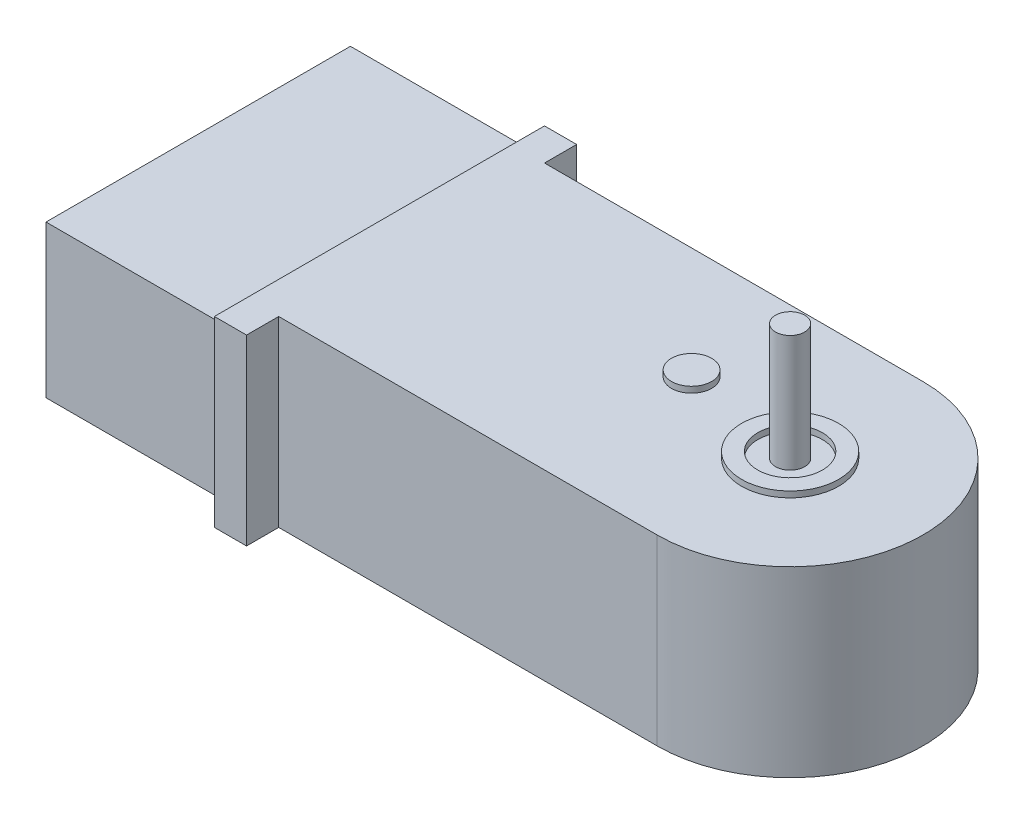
from build123d import *

# Parameters (mm, degrees)
GEAR_BOX_DEPTH      = 6.86
GEAR_BOX_DEPTH_BACK = 6.86
MOTOR_DEPTH         = 5.715
MOTOR_DEPTH_BACK    = 5.715
SKETCH2_W           = 13.61
SKETCH2_H           = 22.86
SKETCH3_R           = 1.51
SKETCH3_R_2         = 3.645
SKETCH3_R_3         = 2.43
SPACER_DEPTH        = 0.45
SPACER_BACK_START   = 0.45
SKETCH5_R           = 3.645
SKETCH5_R_2         = 2.43
SPACER_BACK_DEPTH   = 0.45
SKETCH4_R           = 1.095
OUTPUT_SHAFT_DEPTH  = 8.76


with BuildPart() as part:
    # Sketch1 → Gear Box (new, two sides: drawn at the far end of the back side and taken through both)
    with BuildSketch(Plane(origin=(0, 0, 0), x_dir=(1, 0, 0), z_dir=(0, 1, 0)).offset(-GEAR_BOX_DEPTH_BACK)):
        with BuildLine():
            Line((0, 9.98), (-28.425, 9.98))
            Line((-28.425, 9.98), (-28.425, 12.395))
            Line((-28.425, 12.395), (-30.84, 12.395))
            Line((-30.84, 12.395), (-30.84, -12.395))
            Line((-30.84, -12.395), (-28.425, -12.395))
            Line((-28.425, -12.395), (-28.425, -9.98))
            Line((-28.425, -9.98), (0, -9.98))
            ThreePointArc((0, -9.98), (9.98, 0), (0, 9.98))
        make_face()
    extrude(amount=GEAR_BOX_DEPTH + GEAR_BOX_DEPTH_BACK)

    # Sketch2 → Motor (add, two sides: drawn at the far end of the back side and taken through both)
    with BuildSketch(Plane(origin=(0, 0, 0), x_dir=(1, 0, 0), z_dir=(0, 1, 0)).offset(-MOTOR_DEPTH_BACK)):
        with Locations((-37.645, 0)):
            Rectangle(SKETCH2_W, SKETCH2_H)
    extrude(amount=MOTOR_DEPTH + MOTOR_DEPTH_BACK)

    # Sketch3 → Spacer (add)
    # profile 1 of 2: a face of its own
    with BuildSketch(Plane(origin=(0, 6.86, 0), x_dir=(1, 0, 0), z_dir=(0, 1, 0))):
        with Locations(Location((-9, 1.6, 0), (0, 0, 270))):
            Circle(SKETCH3_R)
    # profile 2 of 2: a face of its own
    with BuildSketch(Plane(origin=(0, 6.86, 0), x_dir=(1, 0, 0), z_dir=(0, 1, 0))):
        with Locations(Location((0, 0, 0), (0, 0, 270))):
            Circle(SKETCH3_R_2)
        with Locations(Location((0, 0, 0), (0, 0, 270))):
            Circle(SKETCH3_R_3, mode=Mode.SUBTRACT)
    extrude(amount=SPACER_DEPTH)

    # Sketch5 → Spacer_back (add)
    with BuildSketch(Plane.XZ.offset(6.86).offset(SPACER_BACK_START)):
        with Locations(Location((0, 0, 0), (0, 0, 90))):
            Circle(SKETCH5_R)
        with Locations(Location((0, 0, 0), (0, 0, 90))):
            Circle(SKETCH5_R_2, mode=Mode.SUBTRACT)
    extrude(amount=-SPACER_BACK_DEPTH)

    # Sketch4 → Output Shaft (add)
    with BuildSketch(Plane(origin=(0, 6.86, 0), x_dir=(1, 0, 0), z_dir=(0, 1, 0))):
        with Locations(Location((0, 0, 0), (0, 0, 270))):
            Circle(SKETCH4_R)
    extrude(amount=OUTPUT_SHAFT_DEPTH)


solid = part.part
